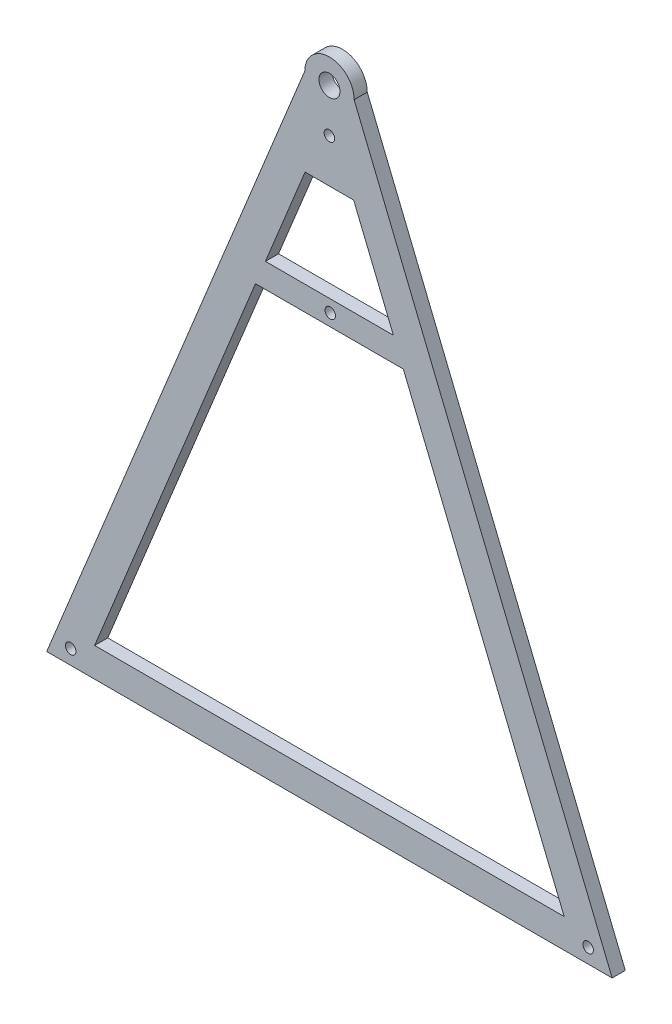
ISO-10303-21;
HEADER;
FILE_DESCRIPTION(('STEP AP214'),'2;1');
FILE_NAME('part.step','',(''),(''),'','','');
FILE_SCHEMA(('AUTOMOTIVE_DESIGN { 1 0 10303 214 1 1 1 1 }'));
ENDSEC;
DATA;
#1=APPLICATION_CONTEXT('core data for automotive mechanical design processes');
#2=APPLICATION_PROTOCOL_DEFINITION('international standard','automotive_design',2000,#1);
#3=PRODUCT_CONTEXT('',#1,'mechanical');
#4=PRODUCT('Part','Part','',(#3));
#5=PRODUCT_RELATED_PRODUCT_CATEGORY('part','',(#4));
#6=PRODUCT_DEFINITION_FORMATION('','',#4);
#7=PRODUCT_DEFINITION_CONTEXT('part definition',#1,'design');
#8=PRODUCT_DEFINITION('design','',#6,#7);
#9=PRODUCT_DEFINITION_SHAPE('','',#8);
#10=(LENGTH_UNIT() NAMED_UNIT(*) SI_UNIT(.MILLI.,.METRE.));
#11=(NAMED_UNIT(*) PLANE_ANGLE_UNIT() SI_UNIT($,.RADIAN.));
#12=(NAMED_UNIT(*) SI_UNIT($,.STERADIAN.) SOLID_ANGLE_UNIT());
#13=UNCERTAINTY_MEASURE_WITH_UNIT(LENGTH_MEASURE(1.E-05),#10,'distance_accuracy_value','');
#14=(GEOMETRIC_REPRESENTATION_CONTEXT(3) GLOBAL_UNCERTAINTY_ASSIGNED_CONTEXT((#13)) GLOBAL_UNIT_ASSIGNED_CONTEXT((#10,
#11,#12)) REPRESENTATION_CONTEXT('',''));
#15=CARTESIAN_POINT('',(0.,0.,0.));
#16=DIRECTION('',(0.,0.,1.));
#17=DIRECTION('',(1.,0.,0.));
#18=AXIS2_PLACEMENT_3D('',#15,#16,#17);
#19=CARTESIAN_POINT('',(4.67846151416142,-1.9112929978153,6.35));
#20=DIRECTION('',(0.925728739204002,-0.378188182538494,0.));
#21=DIRECTION('',(0.378188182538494,0.925728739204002,0.));
#22=AXIS2_PLACEMENT_3D('',#19,#20,#21);
#23=PLANE('',#22);
#24=DIRECTION('',(0.,0.,1.));
#25=VECTOR('',#24,1.);
#26=CARTESIAN_POINT('',(-30.9786295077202,-89.1926926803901,0.));
#27=LINE('',#26,#25);
#28=CARTESIAN_POINT('',(-30.9786295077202,-89.1926926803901,0.));
#29=VERTEX_POINT('',#28);
#30=CARTESIAN_POINT('',(-30.9786295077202,-89.1926926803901,6.35));
#31=VERTEX_POINT('',#30);
#32=EDGE_CURVE('E246',#29,#31,#27,.T.);
#33=ORIENTED_EDGE('',*,*,#32,.F.);
#34=DIRECTION('',(-0.378188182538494,-0.925728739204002,0.));
#35=VECTOR('',#34,1.);
#36=CARTESIAN_POINT('',(4.67846151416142,-1.9112929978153,0.));
#37=LINE('',#36,#35);
#38=CARTESIAN_POINT('',(-11.7703552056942,-42.1746937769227,0.));
#39=VERTEX_POINT('',#38);
#40=EDGE_CURVE('E202',#39,#29,#37,.T.);
#41=ORIENTED_EDGE('',*,*,#40,.F.);
#42=DIRECTION('',(0.,0.,-1.));
#43=VECTOR('',#42,1.);
#44=CARTESIAN_POINT('',(-11.7703552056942,-42.1746937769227,6.35));
#45=LINE('',#44,#43);
#46=CARTESIAN_POINT('',(-11.7703552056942,-42.1746937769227,6.35));
#47=VERTEX_POINT('',#46);
#48=EDGE_CURVE('E11',#47,#39,#45,.T.);
#49=ORIENTED_EDGE('',*,*,#48,.F.);
#50=DIRECTION('',(-0.378188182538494,-0.925728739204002,0.));
#51=VECTOR('',#50,1.);
#52=CARTESIAN_POINT('',(4.67846151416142,-1.9112929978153,6.35));
#53=LINE('',#52,#51);
#54=EDGE_CURVE('E225',#47,#31,#53,.T.);
#55=ORIENTED_EDGE('',*,*,#54,.T.);
#56=EDGE_LOOP('',(#33,#41,#49,#55));
#57=FACE_BOUND('',#56,.T.);
#58=ADVANCED_FACE('F33',(#57),#23,.T.);
#59=CARTESIAN_POINT('',(-4.71391359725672,-1.92577624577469,6.35));
#60=DIRECTION('',(-0.925728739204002,-0.378188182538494,0.));
#61=DIRECTION('',(0.378188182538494,-0.925728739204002,0.));
#62=AXIS2_PLACEMENT_3D('',#59,#60,#61);
#63=PLANE('',#62);
#64=DIRECTION('',(0.,0.,1.));
#65=VECTOR('',#64,1.);
#66=CARTESIAN_POINT('',(30.937260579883,-89.1926926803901,0.));
#67=LINE('',#66,#65);
#68=CARTESIAN_POINT('',(30.9372605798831,-89.1926926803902,0.));
#69=VERTEX_POINT('',#68);
#70=CARTESIAN_POINT('',(30.937260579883,-89.1926926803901,6.35));
#71=VERTEX_POINT('',#70);
#72=EDGE_CURVE('E137',#69,#71,#67,.T.);
#73=ORIENTED_EDGE('',*,*,#72,.T.);
#74=DIRECTION('',(-0.378188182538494,0.925728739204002,0.));
#75=VECTOR('',#74,1.);
#76=CARTESIAN_POINT('',(-4.71391359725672,-1.92577624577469,6.35));
#77=LINE('',#76,#75);
#78=CARTESIAN_POINT('',(11.7289862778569,-42.1746937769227,6.35));
#79=VERTEX_POINT('',#78);
#80=EDGE_CURVE('E219',#71,#79,#77,.T.);
#81=ORIENTED_EDGE('',*,*,#80,.T.);
#82=DIRECTION('',(0.,0.,-1.));
#83=VECTOR('',#82,1.);
#84=CARTESIAN_POINT('',(11.7289862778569,-42.1746937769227,6.35));
#85=LINE('',#84,#83);
#86=CARTESIAN_POINT('',(11.7289862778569,-42.1746937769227,0.));
#87=VERTEX_POINT('',#86);
#88=EDGE_CURVE('E42',#79,#87,#85,.T.);
#89=ORIENTED_EDGE('',*,*,#88,.T.);
#90=DIRECTION('',(-0.378188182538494,0.925728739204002,0.));
#91=VECTOR('',#90,1.);
#92=CARTESIAN_POINT('',(-4.71391359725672,-1.92577624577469,0.));
#93=LINE('',#92,#91);
#94=EDGE_CURVE('E144',#69,#87,#93,.T.);
#95=ORIENTED_EDGE('',*,*,#94,.F.);
#96=EDGE_LOOP('',(#73,#81,#89,#95));
#97=FACE_BOUND('',#96,.T.);
#98=ADVANCED_FACE('F286',(#97),#63,.T.);
#99=DIRECTION('',(0.,0.,1.));
#100=VECTOR('',#99,1.);
#101=CARTESIAN_POINT('',(-35.7816194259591,-100.949447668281,0.));
#102=LINE('',#101,#100);
#103=CARTESIAN_POINT('',(-35.7816194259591,-100.949447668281,0.));
#104=VERTEX_POINT('',#103);
#105=CARTESIAN_POINT('',(-35.7816194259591,-100.949447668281,6.35));
#106=VERTEX_POINT('',#105);
#107=EDGE_CURVE('E126',#104,#106,#102,.T.);
#108=ORIENTED_EDGE('',*,*,#107,.T.);
#109=CARTESIAN_POINT('',(-113.593741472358,-291.417899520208,6.35));
#110=VERTEX_POINT('',#109);
#111=EDGE_CURVE('E209',#106,#110,#53,.T.);
#112=ORIENTED_EDGE('',*,*,#111,.T.);
#113=DIRECTION('',(0.,0.,-1.));
#114=VECTOR('',#113,1.);
#115=CARTESIAN_POINT('',(-113.593741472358,-291.417899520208,6.35));
#116=LINE('',#115,#114);
#117=CARTESIAN_POINT('',(-113.593741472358,-291.417899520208,0.));
#118=VERTEX_POINT('',#117);
#119=EDGE_CURVE('E155',#110,#118,#116,.T.);
#120=ORIENTED_EDGE('',*,*,#119,.T.);
#121=EDGE_CURVE('E201',#104,#118,#37,.T.);
#122=ORIENTED_EDGE('',*,*,#121,.F.);
#123=EDGE_LOOP('',(#108,#112,#120,#122));
#124=FACE_BOUND('',#123,.T.);
#125=ADVANCED_FACE('F207',(#124),#23,.T.);
#126=CARTESIAN_POINT('',(0.,-42.1746937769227,6.35));
#127=DIRECTION('',(0.,-1.,0.));
#128=DIRECTION('',(1.,0.,0.));
#129=AXIS2_PLACEMENT_3D('',#126,#127,#128);
#130=PLANE('',#129);
#131=DIRECTION('',(-1.,0.,0.));
#132=VECTOR('',#131,1.);
#133=CARTESIAN_POINT('',(0.,-42.1746937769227,0.));
#134=LINE('',#133,#132);
#135=EDGE_CURVE('E148',#87,#39,#134,.T.);
#136=ORIENTED_EDGE('',*,*,#135,.F.);
#137=ORIENTED_EDGE('',*,*,#88,.F.);
#138=DIRECTION('',(-1.,0.,0.));
#139=VECTOR('',#138,1.);
#140=CARTESIAN_POINT('',(0.,-42.1746937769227,6.35));
#141=LINE('',#140,#139);
#142=EDGE_CURVE('E221',#79,#47,#141,.T.);
#143=ORIENTED_EDGE('',*,*,#142,.T.);
#144=ORIENTED_EDGE('',*,*,#48,.T.);
#145=EDGE_LOOP('',(#136,#137,#143,#144));
#146=FACE_BOUND('',#145,.T.);
#147=ADVANCED_FACE('F299',(#146),#130,.T.);
#148=DIRECTION('',(0.,0.,1.));
#149=VECTOR('',#148,1.);
#150=CARTESIAN_POINT('',(35.7402504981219,-100.949447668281,0.));
#151=LINE('',#150,#149);
#152=CARTESIAN_POINT('',(35.7402504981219,-100.949447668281,0.));
#153=VERTEX_POINT('',#152);
#154=CARTESIAN_POINT('',(35.7402504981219,-100.949447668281,6.35));
#155=VERTEX_POINT('',#154);
#156=EDGE_CURVE('E123',#153,#155,#151,.T.);
#157=ORIENTED_EDGE('',*,*,#156,.F.);
#158=CARTESIAN_POINT('',(113.552372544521,-291.417899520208,0.));
#159=VERTEX_POINT('',#158);
#160=EDGE_CURVE('E134',#159,#153,#93,.T.);
#161=ORIENTED_EDGE('',*,*,#160,.F.);
#162=DIRECTION('',(0.,0.,-1.));
#163=VECTOR('',#162,1.);
#164=CARTESIAN_POINT('',(113.552372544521,-291.417899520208,6.35));
#165=LINE('',#164,#163);
#166=CARTESIAN_POINT('',(113.552372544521,-291.417899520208,6.35));
#167=VERTEX_POINT('',#166);
#168=EDGE_CURVE('E158',#167,#159,#165,.T.);
#169=ORIENTED_EDGE('',*,*,#168,.F.);
#170=EDGE_CURVE('E136',#167,#155,#77,.T.);
#171=ORIENTED_EDGE('',*,*,#170,.T.);
#172=EDGE_LOOP('',(#157,#161,#169,#171));
#173=FACE_BOUND('',#172,.T.);
#174=ADVANCED_FACE('F133',(#173),#63,.T.);
#175=CARTESIAN_POINT('',(10.2339206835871,4.18086605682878,6.35));
#176=DIRECTION('',(0.925728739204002,0.378188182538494,0.));
#177=DIRECTION('',(-0.378188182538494,0.925728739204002,0.));
#178=AXIS2_PLACEMENT_3D('',#175,#176,#177);
#179=PLANE('',#178);
#180=DIRECTION('',(0.378188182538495,-0.925728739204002,0.));
#181=VECTOR('',#180,1.);
#182=CARTESIAN_POINT('',(10.2339206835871,4.18086605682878,0.));
#183=LINE('',#182,#181);
#184=CARTESIAN_POINT('',(11.941930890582,0.,0.));
#185=VERTEX_POINT('',#184);
#186=CARTESIAN_POINT('',(136.770171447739,-305.554470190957,0.));
#187=VERTEX_POINT('',#186);
#188=EDGE_CURVE('E186',#185,#187,#183,.T.);
#189=ORIENTED_EDGE('',*,*,#188,.F.);
#190=DIRECTION('',(0.,0.,-1.));
#191=VECTOR('',#190,1.);
#192=CARTESIAN_POINT('',(11.941930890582,0.,6.35));
#193=LINE('',#192,#191);
#194=CARTESIAN_POINT('',(11.941930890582,0.,6.35));
#195=VERTEX_POINT('',#194);
#196=EDGE_CURVE('E37',#195,#185,#193,.T.);
#197=ORIENTED_EDGE('',*,*,#196,.F.);
#198=DIRECTION('',(0.378188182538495,-0.925728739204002,0.));
#199=VECTOR('',#198,1.);
#200=CARTESIAN_POINT('',(10.2339206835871,4.18086605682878,6.35));
#201=LINE('',#200,#199);
#202=CARTESIAN_POINT('',(136.770171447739,-305.554470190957,6.35));
#203=VERTEX_POINT('',#202);
#204=EDGE_CURVE('E154',#195,#203,#201,.T.);
#205=ORIENTED_EDGE('',*,*,#204,.T.);
#206=DIRECTION('',(0.,0.,-1.));
#207=VECTOR('',#206,1.);
#208=CARTESIAN_POINT('',(136.770171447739,-305.554470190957,6.35));
#209=LINE('',#208,#207);
#210=EDGE_CURVE('E162',#203,#187,#209,.T.);
#211=ORIENTED_EDGE('',*,*,#210,.T.);
#212=EDGE_LOOP('',(#189,#197,#205,#211));
#213=FACE_BOUND('',#212,.T.);
#214=ADVANCED_FACE('F35',(#213),#179,.T.);
#215=CARTESIAN_POINT('',(0.,0.,6.35));
#216=DIRECTION('',(0.,0.,-1.));
#217=DIRECTION('',(-1.,0.,0.));
#218=AXIS2_PLACEMENT_3D('',#215,#216,#217);
#219=CYLINDRICAL_SURFACE('',#218,11.941930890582);
#220=CARTESIAN_POINT('',(0.,0.,0.));
#221=DIRECTION('',(0.,0.,1.));
#222=DIRECTION('',(1.,0.,0.));
#223=AXIS2_PLACEMENT_3D('',#220,#221,#222);
#224=CIRCLE('',#223,11.941930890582);
#225=CARTESIAN_POINT('',(-11.941930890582,0.,0.));
#226=VERTEX_POINT('',#225);
#227=EDGE_CURVE('E177',#185,#226,#224,.T.);
#228=ORIENTED_EDGE('',*,*,#227,.T.);
#229=DIRECTION('',(0.,0.,-1.));
#230=VECTOR('',#229,1.);
#231=CARTESIAN_POINT('',(-11.941930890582,0.,6.35));
#232=LINE('',#231,#230);
#233=CARTESIAN_POINT('',(-11.941930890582,0.,6.35));
#234=VERTEX_POINT('',#233);
#235=EDGE_CURVE('E167',#234,#226,#232,.T.);
#236=ORIENTED_EDGE('',*,*,#235,.F.);
#237=CARTESIAN_POINT('',(0.,0.,6.35));
#238=DIRECTION('',(0.,0.,1.));
#239=DIRECTION('',(1.,0.,0.));
#240=AXIS2_PLACEMENT_3D('',#237,#238,#239);
#241=CIRCLE('',#240,11.941930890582);
#242=EDGE_CURVE('E178',#195,#234,#241,.T.);
#243=ORIENTED_EDGE('',*,*,#242,.F.);
#244=ORIENTED_EDGE('',*,*,#196,.T.);
#245=EDGE_LOOP('',(#228,#236,#243,#244));
#246=FACE_BOUND('',#245,.T.);
#247=ADVANCED_FACE('F176',(#246),#219,.T.);
#248=CARTESIAN_POINT('',(-10.2339206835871,4.18086605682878,6.35));
#249=DIRECTION('',(0.925728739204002,-0.378188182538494,0.));
#250=DIRECTION('',(0.378188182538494,0.925728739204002,0.));
#251=AXIS2_PLACEMENT_3D('',#248,#249,#250);
#252=PLANE('',#251);
#253=DIRECTION('',(-0.378188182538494,-0.925728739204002,0.));
#254=VECTOR('',#253,1.);
#255=CARTESIAN_POINT('',(-10.2339206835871,4.18086605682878,0.));
#256=LINE('',#255,#254);
#257=CARTESIAN_POINT('',(-136.770171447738,-305.554470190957,0.));
#258=VERTEX_POINT('',#257);
#259=EDGE_CURVE('E187',#226,#258,#256,.T.);
#260=ORIENTED_EDGE('',*,*,#259,.T.);
#261=DIRECTION('',(0.,0.,-1.));
#262=VECTOR('',#261,1.);
#263=CARTESIAN_POINT('',(-136.770171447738,-305.554470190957,6.35));
#264=LINE('',#263,#262);
#265=CARTESIAN_POINT('',(-136.770171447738,-305.554470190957,6.35));
#266=VERTEX_POINT('',#265);
#267=EDGE_CURVE('E164',#266,#258,#264,.T.);
#268=ORIENTED_EDGE('',*,*,#267,.F.);
#269=DIRECTION('',(-0.378188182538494,-0.925728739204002,0.));
#270=VECTOR('',#269,1.);
#271=CARTESIAN_POINT('',(-10.2339206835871,4.18086605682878,6.35));
#272=LINE('',#271,#270);
#273=EDGE_CURVE('E230',#234,#266,#272,.T.);
#274=ORIENTED_EDGE('',*,*,#273,.F.);
#275=ORIENTED_EDGE('',*,*,#235,.T.);
#276=EDGE_LOOP('',(#260,#268,#274,#275));
#277=FACE_BOUND('',#276,.T.);
#278=ADVANCED_FACE('F311',(#277),#252,.F.);
#279=CARTESIAN_POINT('',(0.,-291.417899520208,6.35));
#280=DIRECTION('',(0.,-1.,0.));
#281=DIRECTION('',(1.,0.,0.));
#282=AXIS2_PLACEMENT_3D('',#279,#280,#281);
#283=PLANE('',#282);
#284=DIRECTION('',(-1.,0.,0.));
#285=VECTOR('',#284,1.);
#286=CARTESIAN_POINT('',(0.,-291.417899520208,0.));
#287=LINE('',#286,#285);
#288=EDGE_CURVE('E143',#159,#118,#287,.T.);
#289=ORIENTED_EDGE('',*,*,#288,.T.);
#290=ORIENTED_EDGE('',*,*,#119,.F.);
#291=DIRECTION('',(-1.,0.,0.));
#292=VECTOR('',#291,1.);
#293=CARTESIAN_POINT('',(0.,-291.417899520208,6.35));
#294=LINE('',#293,#292);
#295=EDGE_CURVE('E214',#167,#110,#294,.T.);
#296=ORIENTED_EDGE('',*,*,#295,.F.);
#297=ORIENTED_EDGE('',*,*,#168,.T.);
#298=EDGE_LOOP('',(#289,#290,#296,#297));
#299=FACE_BOUND('',#298,.T.);
#300=ADVANCED_FACE('F213',(#299),#283,.F.);
#301=CARTESIAN_POINT('',(0.,-305.554470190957,6.35));
#302=DIRECTION('',(0.,1.,0.));
#303=DIRECTION('',(-1.,0.,0.));
#304=AXIS2_PLACEMENT_3D('',#301,#302,#303);
#305=PLANE('',#304);
#306=DIRECTION('',(1.,0.,0.));
#307=VECTOR('',#306,1.);
#308=CARTESIAN_POINT('',(0.,-305.554470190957,0.));
#309=LINE('',#308,#307);
#310=EDGE_CURVE('E200',#258,#187,#309,.T.);
#311=ORIENTED_EDGE('',*,*,#310,.T.);
#312=ORIENTED_EDGE('',*,*,#210,.F.);
#313=DIRECTION('',(1.,0.,0.));
#314=VECTOR('',#313,1.);
#315=CARTESIAN_POINT('',(0.,-305.554470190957,6.35));
#316=LINE('',#315,#314);
#317=EDGE_CURVE('E228',#266,#203,#316,.T.);
#318=ORIENTED_EDGE('',*,*,#317,.F.);
#319=ORIENTED_EDGE('',*,*,#267,.T.);
#320=EDGE_LOOP('',(#311,#312,#318,#319));
#321=FACE_BOUND('',#320,.T.);
#322=ADVANCED_FACE('F281',(#321),#305,.F.);
#323=CARTESIAN_POINT('',(0.,0.,6.35));
#324=DIRECTION('',(0.,0.,-1.));
#325=DIRECTION('',(-1.,0.,0.));
#326=AXIS2_PLACEMENT_3D('',#323,#324,#325);
#327=CYLINDRICAL_SURFACE('',#326,5.08);
#328=CARTESIAN_POINT('',(0.,0.,6.35));
#329=DIRECTION('',(0.,0.,1.));
#330=DIRECTION('',(1.,0.,0.));
#331=AXIS2_PLACEMENT_3D('',#328,#329,#330);
#332=CIRCLE('',#331,5.08);
#333=CARTESIAN_POINT('',(5.08,0.,6.35));
#334=VERTEX_POINT('',#333);
#335=EDGE_CURVE('E165',#334,#334,#332,.T.);
#336=ORIENTED_EDGE('',*,*,#335,.T.);
#337=EDGE_LOOP('',(#336));
#338=FACE_BOUND('',#337,.T.);
#339=CARTESIAN_POINT('',(0.,0.,0.));
#340=DIRECTION('',(0.,0.,1.));
#341=DIRECTION('',(1.,0.,0.));
#342=AXIS2_PLACEMENT_3D('',#339,#340,#341);
#343=CIRCLE('',#342,5.08);
#344=CARTESIAN_POINT('',(5.08,0.,0.));
#345=VERTEX_POINT('',#344);
#346=EDGE_CURVE('E146',#345,#345,#343,.T.);
#347=ORIENTED_EDGE('',*,*,#346,.F.);
#348=EDGE_LOOP('',(#347));
#349=FACE_BOUND('',#348,.T.);
#350=ADVANCED_FACE('F272',(#338,#349),#327,.F.);
#351=CARTESIAN_POINT('',(0.,0.,6.35));
#352=DIRECTION('',(0.,0.,1.));
#353=DIRECTION('',(1.,0.,0.));
#354=AXIS2_PLACEMENT_3D('',#351,#352,#353);
#355=PLANE('',#354);
#356=CARTESIAN_POINT('',(0.408650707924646,-95.1115085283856,6.35));
#357=DIRECTION('',(0.,0.,1.));
#358=DIRECTION('',(1.,0.,0.));
#359=AXIS2_PLACEMENT_3D('',#356,#357,#358);
#360=CIRCLE('',#359,2.54);
#361=CARTESIAN_POINT('',(2.94865070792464,-95.1115085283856,6.35));
#362=VERTEX_POINT('',#361);
#363=EDGE_CURVE('E258',#362,#362,#360,.T.);
#364=ORIENTED_EDGE('',*,*,#363,.F.);
#365=EDGE_LOOP('',(#364));
#366=FACE_BOUND('',#365,.T.);
#367=ORIENTED_EDGE('',*,*,#111,.F.);
#368=DIRECTION('',(1.,0.,0.));
#369=VECTOR('',#368,1.);
#370=CARTESIAN_POINT('',(-35.7816194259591,-100.949447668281,6.35));
#371=LINE('',#370,#369);
#372=EDGE_CURVE('E218',#106,#155,#371,.T.);
#373=ORIENTED_EDGE('',*,*,#372,.T.);
#374=ORIENTED_EDGE('',*,*,#170,.F.);
#375=ORIENTED_EDGE('',*,*,#295,.T.);
#376=EDGE_LOOP('',(#367,#373,#374,#375));
#377=FACE_BOUND('',#376,.T.);
#378=CARTESIAN_POINT('',(-0.0103422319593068,-21.0873468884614,6.35));
#379=DIRECTION('',(0.,0.,1.));
#380=DIRECTION('',(1.,0.,0.));
#381=AXIS2_PLACEMENT_3D('',#378,#379,#380);
#382=CIRCLE('',#381,2.54);
#383=CARTESIAN_POINT('',(2.52965776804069,-21.0873468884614,6.35));
#384=VERTEX_POINT('',#383);
#385=EDGE_CURVE('E243',#384,#384,#382,.T.);
#386=ORIENTED_EDGE('',*,*,#385,.F.);
#387=EDGE_LOOP('',(#386));
#388=FACE_BOUND('',#387,.T.);
#389=CARTESIAN_POINT('',(-125.181956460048,-298.486184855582,6.35));
#390=DIRECTION('',(0.,0.,1.));
#391=DIRECTION('',(1.,0.,0.));
#392=AXIS2_PLACEMENT_3D('',#389,#390,#391);
#393=CIRCLE('',#392,2.54);
#394=CARTESIAN_POINT('',(-122.641956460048,-298.486184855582,6.35));
#395=VERTEX_POINT('',#394);
#396=EDGE_CURVE('E237',#395,#395,#393,.T.);
#397=ORIENTED_EDGE('',*,*,#396,.F.);
#398=EDGE_LOOP('',(#397));
#399=FACE_BOUND('',#398,.T.);
#400=CARTESIAN_POINT('',(125.16127199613,-298.486184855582,6.35));
#401=DIRECTION('',(0.,0.,1.));
#402=DIRECTION('',(1.,0.,0.));
#403=AXIS2_PLACEMENT_3D('',#400,#401,#402);
#404=CIRCLE('',#403,2.53999999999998);
#405=CARTESIAN_POINT('',(127.70127199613,-298.486184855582,6.35));
#406=VERTEX_POINT('',#405);
#407=EDGE_CURVE('E194',#406,#406,#404,.T.);
#408=ORIENTED_EDGE('',*,*,#407,.F.);
#409=EDGE_LOOP('',(#408));
#410=FACE_BOUND('',#409,.T.);
#411=ORIENTED_EDGE('',*,*,#204,.F.);
#412=ORIENTED_EDGE('',*,*,#242,.T.);
#413=ORIENTED_EDGE('',*,*,#273,.T.);
#414=ORIENTED_EDGE('',*,*,#317,.T.);
#415=EDGE_LOOP('',(#411,#412,#413,#414));
#416=FACE_BOUND('',#415,.T.);
#417=ORIENTED_EDGE('',*,*,#54,.F.);
#418=ORIENTED_EDGE('',*,*,#142,.F.);
#419=ORIENTED_EDGE('',*,*,#80,.F.);
#420=DIRECTION('',(-1.,0.,0.));
#421=VECTOR('',#420,1.);
#422=CARTESIAN_POINT('',(-30.9786295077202,-89.1926926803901,6.35));
#423=LINE('',#422,#421);
#424=EDGE_CURVE('E128',#71,#31,#423,.T.);
#425=ORIENTED_EDGE('',*,*,#424,.T.);
#426=EDGE_LOOP('',(#417,#418,#419,#425));
#427=FACE_BOUND('',#426,.T.);
#428=ORIENTED_EDGE('',*,*,#335,.F.);
#429=EDGE_LOOP('',(#428));
#430=FACE_BOUND('',#429,.T.);
#431=ADVANCED_FACE('F216',(#366,#377,#388,#399,#410,#416,#427,#430),#355,.T.);
#432=CARTESIAN_POINT('',(0.,0.,0.));
#433=DIRECTION('',(0.,0.,1.));
#434=DIRECTION('',(1.,0.,0.));
#435=AXIS2_PLACEMENT_3D('',#432,#433,#434);
#436=PLANE('',#435);
#437=CARTESIAN_POINT('',(0.408650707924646,-95.1115085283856,0.));
#438=DIRECTION('',(0.,0.,1.));
#439=DIRECTION('',(1.,0.,0.));
#440=AXIS2_PLACEMENT_3D('',#437,#438,#439);
#441=CIRCLE('',#440,2.54);
#442=CARTESIAN_POINT('',(2.94865070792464,-95.1115085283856,0.));
#443=VERTEX_POINT('',#442);
#444=EDGE_CURVE('E256',#443,#443,#441,.T.);
#445=ORIENTED_EDGE('',*,*,#444,.T.);
#446=EDGE_LOOP('',(#445));
#447=FACE_BOUND('',#446,.T.);
#448=DIRECTION('',(1.,0.,0.));
#449=VECTOR('',#448,1.);
#450=CARTESIAN_POINT('',(-35.7816194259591,-100.949447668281,0.));
#451=LINE('',#450,#449);
#452=EDGE_CURVE('E58',#104,#153,#451,.T.);
#453=ORIENTED_EDGE('',*,*,#452,.F.);
#454=ORIENTED_EDGE('',*,*,#121,.T.);
#455=ORIENTED_EDGE('',*,*,#288,.F.);
#456=ORIENTED_EDGE('',*,*,#160,.T.);
#457=EDGE_LOOP('',(#453,#454,#455,#456));
#458=FACE_BOUND('',#457,.T.);
#459=CARTESIAN_POINT('',(-0.0103422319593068,-21.0873468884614,0.));
#460=DIRECTION('',(0.,0.,1.));
#461=DIRECTION('',(1.,0.,0.));
#462=AXIS2_PLACEMENT_3D('',#459,#460,#461);
#463=CIRCLE('',#462,2.54);
#464=CARTESIAN_POINT('',(2.52965776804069,-21.0873468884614,0.));
#465=VERTEX_POINT('',#464);
#466=EDGE_CURVE('E240',#465,#465,#463,.T.);
#467=ORIENTED_EDGE('',*,*,#466,.T.);
#468=EDGE_LOOP('',(#467));
#469=FACE_BOUND('',#468,.T.);
#470=CARTESIAN_POINT('',(-125.181956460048,-298.486184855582,0.));
#471=DIRECTION('',(0.,0.,1.));
#472=DIRECTION('',(1.,0.,0.));
#473=AXIS2_PLACEMENT_3D('',#470,#471,#472);
#474=CIRCLE('',#473,2.54);
#475=CARTESIAN_POINT('',(-122.641956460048,-298.486184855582,0.));
#476=VERTEX_POINT('',#475);
#477=EDGE_CURVE('E235',#476,#476,#474,.T.);
#478=ORIENTED_EDGE('',*,*,#477,.T.);
#479=EDGE_LOOP('',(#478));
#480=FACE_BOUND('',#479,.T.);
#481=CARTESIAN_POINT('',(125.16127199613,-298.486184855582,0.));
#482=DIRECTION('',(0.,0.,1.));
#483=DIRECTION('',(1.,0.,0.));
#484=AXIS2_PLACEMENT_3D('',#481,#482,#483);
#485=CIRCLE('',#484,2.53999999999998);
#486=CARTESIAN_POINT('',(127.70127199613,-298.486184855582,0.));
#487=VERTEX_POINT('',#486);
#488=EDGE_CURVE('E191',#487,#487,#485,.T.);
#489=ORIENTED_EDGE('',*,*,#488,.T.);
#490=EDGE_LOOP('',(#489));
#491=FACE_BOUND('',#490,.T.);
#492=ORIENTED_EDGE('',*,*,#188,.T.);
#493=ORIENTED_EDGE('',*,*,#310,.F.);
#494=ORIENTED_EDGE('',*,*,#259,.F.);
#495=ORIENTED_EDGE('',*,*,#227,.F.);
#496=EDGE_LOOP('',(#492,#493,#494,#495));
#497=FACE_BOUND('',#496,.T.);
#498=ORIENTED_EDGE('',*,*,#40,.T.);
#499=DIRECTION('',(-1.,0.,0.));
#500=VECTOR('',#499,1.);
#501=CARTESIAN_POINT('',(-30.9786295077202,-89.1926926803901,0.));
#502=LINE('',#501,#500);
#503=EDGE_CURVE('E50',#69,#29,#502,.T.);
#504=ORIENTED_EDGE('',*,*,#503,.F.);
#505=ORIENTED_EDGE('',*,*,#94,.T.);
#506=ORIENTED_EDGE('',*,*,#135,.T.);
#507=EDGE_LOOP('',(#498,#504,#505,#506));
#508=FACE_BOUND('',#507,.T.);
#509=ORIENTED_EDGE('',*,*,#346,.T.);
#510=EDGE_LOOP('',(#509));
#511=FACE_BOUND('',#510,.T.);
#512=ADVANCED_FACE('F140',(#447,#458,#469,#480,#491,#497,#508,#511),#436,.F.);
#513=CARTESIAN_POINT('',(125.16127199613,-298.486184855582,0.));
#514=DIRECTION('',(0.,0.,1.));
#515=DIRECTION('',(1.,0.,0.));
#516=AXIS2_PLACEMENT_3D('',#513,#514,#515);
#517=CYLINDRICAL_SURFACE('',#516,2.53999999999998);
#518=ORIENTED_EDGE('',*,*,#488,.F.);
#519=EDGE_LOOP('',(#518));
#520=FACE_BOUND('',#519,.T.);
#521=ORIENTED_EDGE('',*,*,#407,.T.);
#522=EDGE_LOOP('',(#521));
#523=FACE_BOUND('',#522,.T.);
#524=ADVANCED_FACE('F278',(#520,#523),#517,.F.);
#525=CARTESIAN_POINT('',(-125.181956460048,-298.486184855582,0.));
#526=DIRECTION('',(0.,0.,1.));
#527=DIRECTION('',(1.,0.,0.));
#528=AXIS2_PLACEMENT_3D('',#525,#526,#527);
#529=CYLINDRICAL_SURFACE('',#528,2.54);
#530=ORIENTED_EDGE('',*,*,#477,.F.);
#531=EDGE_LOOP('',(#530));
#532=FACE_BOUND('',#531,.T.);
#533=ORIENTED_EDGE('',*,*,#396,.T.);
#534=EDGE_LOOP('',(#533));
#535=FACE_BOUND('',#534,.T.);
#536=ADVANCED_FACE('F346',(#532,#535),#529,.F.);
#537=CARTESIAN_POINT('',(-0.0103422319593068,-21.0873468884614,0.));
#538=DIRECTION('',(0.,0.,1.));
#539=DIRECTION('',(1.,0.,0.));
#540=AXIS2_PLACEMENT_3D('',#537,#538,#539);
#541=CYLINDRICAL_SURFACE('',#540,2.54);
#542=ORIENTED_EDGE('',*,*,#466,.F.);
#543=EDGE_LOOP('',(#542));
#544=FACE_BOUND('',#543,.T.);
#545=ORIENTED_EDGE('',*,*,#385,.T.);
#546=EDGE_LOOP('',(#545));
#547=FACE_BOUND('',#546,.T.);
#548=ADVANCED_FACE('F339',(#544,#547),#541,.F.);
#549=CARTESIAN_POINT('',(-30.9786295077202,-89.1926926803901,0.));
#550=DIRECTION('',(0.,1.,0.));
#551=DIRECTION('',(0.,0.,1.));
#552=AXIS2_PLACEMENT_3D('',#549,#550,#551);
#553=PLANE('',#552);
#554=ORIENTED_EDGE('',*,*,#424,.F.);
#555=ORIENTED_EDGE('',*,*,#72,.F.);
#556=ORIENTED_EDGE('',*,*,#503,.T.);
#557=ORIENTED_EDGE('',*,*,#32,.T.);
#558=EDGE_LOOP('',(#554,#555,#556,#557));
#559=FACE_BOUND('',#558,.T.);
#560=ADVANCED_FACE('F337',(#559),#553,.T.);
#561=CARTESIAN_POINT('',(-35.7816194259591,-100.949447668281,0.));
#562=DIRECTION('',(0.,-1.,0.));
#563=DIRECTION('',(1.,0.,0.));
#564=AXIS2_PLACEMENT_3D('',#561,#562,#563);
#565=PLANE('',#564);
#566=ORIENTED_EDGE('',*,*,#372,.F.);
#567=ORIENTED_EDGE('',*,*,#107,.F.);
#568=ORIENTED_EDGE('',*,*,#452,.T.);
#569=ORIENTED_EDGE('',*,*,#156,.T.);
#570=EDGE_LOOP('',(#566,#567,#568,#569));
#571=FACE_BOUND('',#570,.T.);
#572=ADVANCED_FACE('F122',(#571),#565,.T.);
#573=CARTESIAN_POINT('',(0.408650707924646,-95.1115085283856,0.));
#574=DIRECTION('',(0.,0.,1.));
#575=DIRECTION('',(1.,0.,0.));
#576=AXIS2_PLACEMENT_3D('',#573,#574,#575);
#577=CYLINDRICAL_SURFACE('',#576,2.54);
#578=ORIENTED_EDGE('',*,*,#444,.F.);
#579=EDGE_LOOP('',(#578));
#580=FACE_BOUND('',#579,.T.);
#581=ORIENTED_EDGE('',*,*,#363,.T.);
#582=EDGE_LOOP('',(#581));
#583=FACE_BOUND('',#582,.T.);
#584=ADVANCED_FACE('F265',(#580,#583),#577,.F.);
#585=CLOSED_SHELL('',(#58,#98,#125,#147,#174,#214,#247,#278,#300,#322,#350,#431,#512,#524,#536,
#548,#560,#572,#584));
#586=MANIFOLD_SOLID_BREP('B2',#585);
#587=ADVANCED_BREP_SHAPE_REPRESENTATION('',(#18,#586),#14);
#588=SHAPE_DEFINITION_REPRESENTATION(#9,#587);
ENDSEC;
END-ISO-10303-21;
